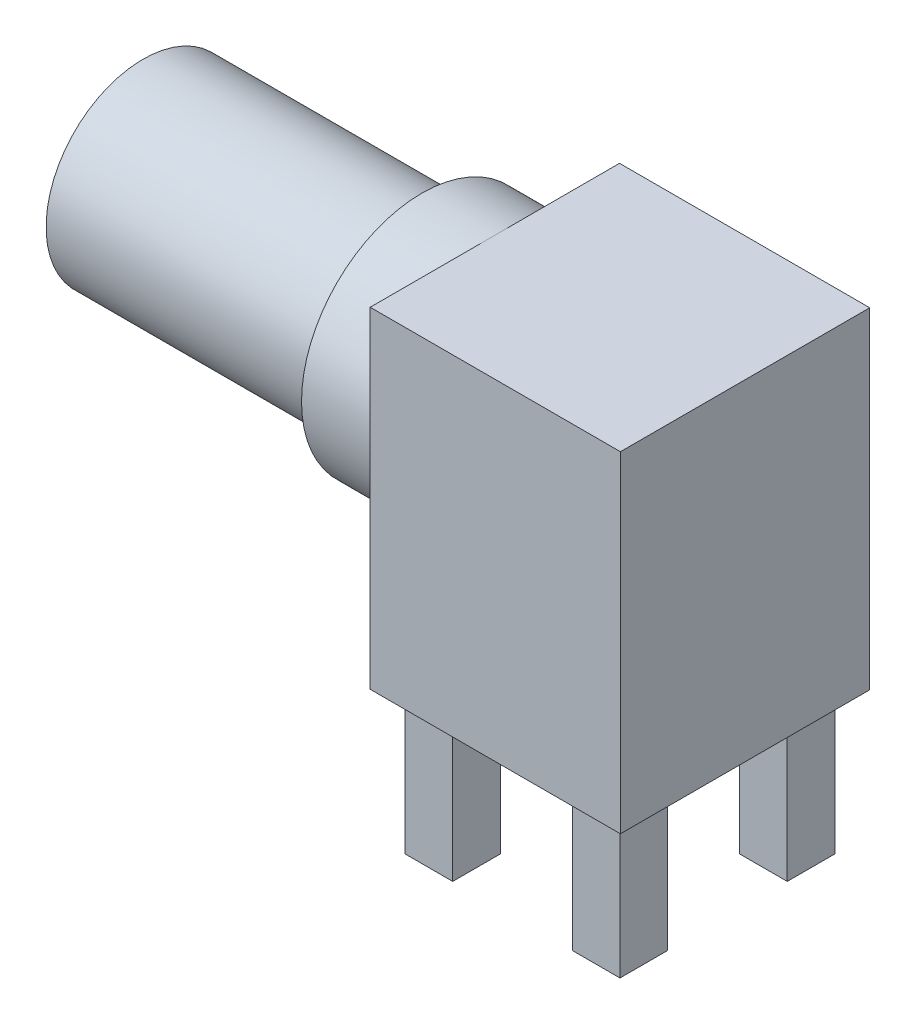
from build123d import *

# Parameters (mm, degrees)
SKETCH1_W           = 7.0104
SKETCH1_H           = 9.271
BOSS_EXTRUDE1_DEPTH = 3.4925
SKETCH2_R           = 3.37185
BOSS_EXTRUDE2_DEPTH = 2.0447
SKETCH3_R           = 2.7178
BOSS_EXTRUDE3_DEPTH = 7.8105
SKETCH4_R           = 2.192528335
SKETCH4_R_2         = 0.636954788
CUT_EXTRUDE1_DEPTH  = 3.175
SKETCH5_R           = 0.7874
SKETCH5_W           = 1.3335
SKETCH5_H           = 1.3335
BOSS_EXTRUDE4_DEPTH = 3.9878
CUT_EXTRUDE2_START  = -0.127
SKETCH6_R           = 1.27
SKETCH6_R_2         = 0.7874
CUT_EXTRUDE2_DEPTH  = 0.127


with BuildPart() as part:
    # Sketch1 → Boss-Extrude1 (new, symmetric)
    with BuildSketch(Plane.XY):
        Rectangle(SKETCH1_W, SKETCH1_H)
    extrude(amount=BOSS_EXTRUDE1_DEPTH, both=True)

    # Sketch2 → Boss-Extrude2 (add)
    with BuildSketch(Plane.ZY.offset(3.5052)):
        with Locations(Location((0, 1.26365, 0), (0, 0, 90))):
            Circle(SKETCH2_R)
    extrude(amount=BOSS_EXTRUDE2_DEPTH)

    # Sketch3 → Boss-Extrude3 (add)
    with BuildSketch(Plane.ZY.offset(5.5499)):
        with Locations(Location((0, 1.26365, 0), (0, 0, 180))):
            Circle(SKETCH3_R)
    extrude(amount=BOSS_EXTRUDE3_DEPTH)

    # Sketch4 → Cut-Extrude1 (cut)
    with BuildSketch(Plane.ZY.offset(13.3604)):
        with Locations((0, 1.26365)):
            Circle(SKETCH4_R)
        with Locations((0, 1.26365)):
            Circle(SKETCH4_R_2, mode=Mode.SUBTRACT)
    extrude(amount=-CUT_EXTRUDE1_DEPTH, mode=Mode.SUBTRACT)

    # Sketch5 → Boss-Extrude4 (add)
    with BuildSketch(Plane.XZ.offset(4.6355)):
        with Locations(Location((0, 0, 0), (0, 0, 90))):
            Circle(SKETCH5_R)
        with Locations((-2.34315, 2.34315)):
            Rectangle(SKETCH5_W, SKETCH5_H)
        with Locations((2.34315, 2.34315)):
            Rectangle(SKETCH5_W, SKETCH5_H)
        with Locations((2.34315, -2.34315)):
            Rectangle(SKETCH5_W, SKETCH5_H)
        with Locations((-2.34315, -2.34315)):
            Rectangle(SKETCH5_W, SKETCH5_H)
    extrude(amount=BOSS_EXTRUDE4_DEPTH)

    # Sketch6 → Cut-Extrude2 (cut)
    with BuildSketch(Plane.XZ.offset(4.6355).offset(CUT_EXTRUDE2_START)):
        with Locations(Location((0, 0, 0), (0, 0, 270))):
            Circle(SKETCH6_R)
        with Locations(Location((0, 0, 0), (0, 0, 270))):
            Circle(SKETCH6_R_2, mode=Mode.SUBTRACT)
    extrude(amount=CUT_EXTRUDE2_DEPTH, mode=Mode.SUBTRACT)


solid = part.part
